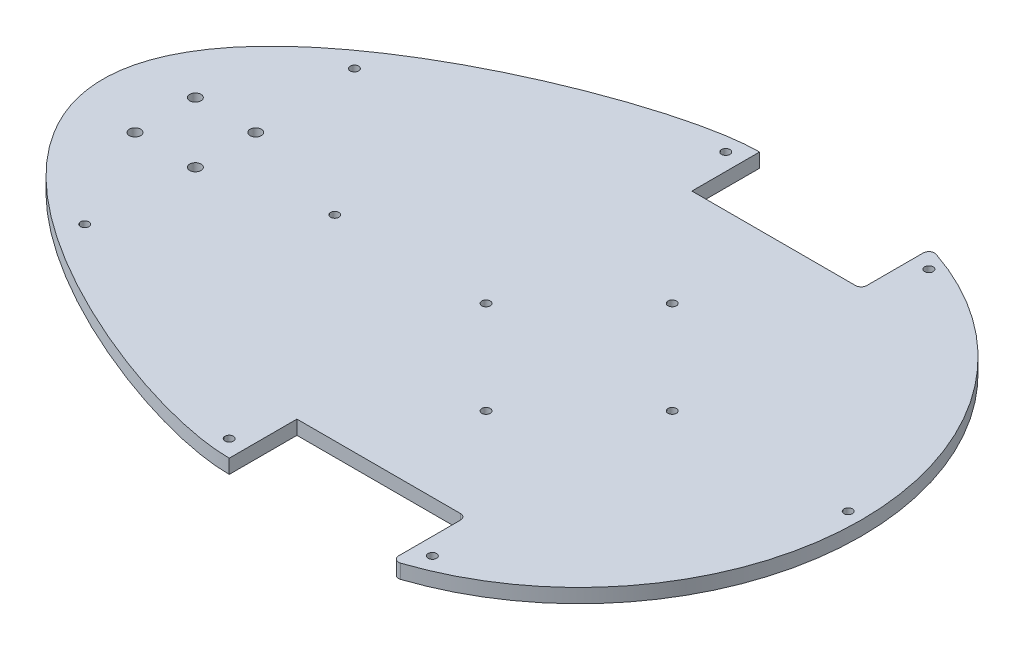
ISO-10303-21;
HEADER;
FILE_DESCRIPTION(('STEP AP214'),'2;1');
FILE_NAME('part.step','',(''),(''),'','','');
FILE_SCHEMA(('AUTOMOTIVE_DESIGN { 1 0 10303 214 1 1 1 1 }'));
ENDSEC;
DATA;
#1=APPLICATION_CONTEXT('core data for automotive mechanical design processes');
#2=APPLICATION_PROTOCOL_DEFINITION('international standard','automotive_design',2000,#1);
#3=PRODUCT_CONTEXT('',#1,'mechanical');
#4=PRODUCT('Part','Part','',(#3));
#5=PRODUCT_RELATED_PRODUCT_CATEGORY('part','',(#4));
#6=PRODUCT_DEFINITION_FORMATION('','',#4);
#7=PRODUCT_DEFINITION_CONTEXT('part definition',#1,'design');
#8=PRODUCT_DEFINITION('design','',#6,#7);
#9=PRODUCT_DEFINITION_SHAPE('','',#8);
#10=(LENGTH_UNIT() NAMED_UNIT(*) SI_UNIT(.MILLI.,.METRE.));
#11=(NAMED_UNIT(*) PLANE_ANGLE_UNIT() SI_UNIT($,.RADIAN.));
#12=(NAMED_UNIT(*) SI_UNIT($,.STERADIAN.) SOLID_ANGLE_UNIT());
#13=UNCERTAINTY_MEASURE_WITH_UNIT(LENGTH_MEASURE(1.E-05),#10,'distance_accuracy_value','');
#14=(GEOMETRIC_REPRESENTATION_CONTEXT(3) GLOBAL_UNCERTAINTY_ASSIGNED_CONTEXT((#13)) GLOBAL_UNIT_ASSIGNED_CONTEXT((#10,
#11,#12)) REPRESENTATION_CONTEXT('',''));
#15=CARTESIAN_POINT('',(0.,0.,0.));
#16=DIRECTION('',(0.,0.,1.));
#17=DIRECTION('',(1.,0.,0.));
#18=AXIS2_PLACEMENT_3D('',#15,#16,#17);
#19=CARTESIAN_POINT('',(-138.776487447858,6.35,-10.414919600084));
#20=DIRECTION('',(0.,-1.,0.));
#21=DIRECTION('',(0.,0.,-1.));
#22=AXIS2_PLACEMENT_3D('',#19,#20,#21);
#23=PLANE('',#22);
#24=CARTESIAN_POINT('',(-33.683987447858,6.35,-9.65291960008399));
#25=DIRECTION('',(0.,1.,0.));
#26=DIRECTION('',(0.,0.,1.));
#27=AXIS2_PLACEMENT_3D('',#24,#25,#26);
#28=CIRCLE('',#27,1.905);
#29=CARTESIAN_POINT('',(-33.683987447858,6.35,-7.74791960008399));
#30=VERTEX_POINT('',#29);
#31=EDGE_CURVE('E306',#30,#30,#28,.T.);
#32=ORIENTED_EDGE('',*,*,#31,.F.);
#33=EDGE_LOOP('',(#32));
#34=FACE_BOUND('',#33,.T.);
#35=CARTESIAN_POINT('',(197.456012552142,6.35,-9.65291960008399));
#36=DIRECTION('',(0.,1.,0.));
#37=DIRECTION('',(0.,0.,1.));
#38=AXIS2_PLACEMENT_3D('',#35,#36,#37);
#39=CIRCLE('',#38,1.90499999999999);
#40=CARTESIAN_POINT('',(197.456012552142,6.35,-7.747919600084));
#41=VERTEX_POINT('',#40);
#42=EDGE_CURVE('E300',#41,#41,#39,.T.);
#43=ORIENTED_EDGE('',*,*,#42,.F.);
#44=EDGE_LOOP('',(#43));
#45=FACE_BOUND('',#44,.T.);
#46=CARTESIAN_POINT('',(-86.2919229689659,6.35,-71.120919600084));
#47=DIRECTION('',(0.,1.,0.));
#48=DIRECTION('',(0.,0.,1.));
#49=AXIS2_PLACEMENT_3D('',#46,#47,#48);
#50=CIRCLE('',#49,1.90500000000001);
#51=CARTESIAN_POINT('',(-86.2919229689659,6.35,-69.215919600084));
#52=VERTEX_POINT('',#51);
#53=EDGE_CURVE('E292',#52,#52,#50,.T.);
#54=ORIENTED_EDGE('',*,*,#53,.F.);
#55=EDGE_LOOP('',(#54));
#56=FACE_BOUND('',#55,.T.);
#57=CARTESIAN_POINT('',(-86.2919229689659,6.35,50.291080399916));
#58=DIRECTION('',(0.,1.,0.));
#59=DIRECTION('',(0.,0.,1.));
#60=AXIS2_PLACEMENT_3D('',#57,#58,#59);
#61=CIRCLE('',#60,1.90500000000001);
#62=CARTESIAN_POINT('',(-86.2919229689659,6.35,52.196080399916));
#63=VERTEX_POINT('',#62);
#64=EDGE_CURVE('E285',#63,#63,#61,.T.);
#65=ORIENTED_EDGE('',*,*,#64,.F.);
#66=EDGE_LOOP('',(#65));
#67=FACE_BOUND('',#66,.T.);
#68=CARTESIAN_POINT('',(29.816012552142,6.35,101.345080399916));
#69=DIRECTION('',(0.,1.,0.));
#70=DIRECTION('',(0.,0.,1.));
#71=AXIS2_PLACEMENT_3D('',#68,#69,#70);
#72=CIRCLE('',#71,1.905);
#73=CARTESIAN_POINT('',(29.816012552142,6.35,103.250080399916));
#74=VERTEX_POINT('',#73);
#75=EDGE_CURVE('E289',#74,#74,#72,.T.);
#76=ORIENTED_EDGE('',*,*,#75,.F.);
#77=EDGE_LOOP('',(#76));
#78=FACE_BOUND('',#77,.T.);
#79=CARTESIAN_POINT('',(29.816012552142,6.35,-122.174919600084));
#80=DIRECTION('',(0.,1.,0.));
#81=DIRECTION('',(0.,0.,1.));
#82=AXIS2_PLACEMENT_3D('',#79,#80,#81);
#83=CIRCLE('',#82,1.905);
#84=CARTESIAN_POINT('',(29.816012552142,6.35,-120.269919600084));
#85=VERTEX_POINT('',#84);
#86=EDGE_CURVE('E319',#85,#85,#83,.T.);
#87=ORIENTED_EDGE('',*,*,#86,.F.);
#88=EDGE_LOOP('',(#87));
#89=FACE_BOUND('',#88,.T.);
#90=CARTESIAN_POINT('',(121.256012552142,6.35,-122.174919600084));
#91=DIRECTION('',(0.,1.,0.));
#92=DIRECTION('',(0.,0.,1.));
#93=AXIS2_PLACEMENT_3D('',#90,#91,#92);
#94=CIRCLE('',#93,1.90500000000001);
#95=CARTESIAN_POINT('',(121.256012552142,6.35,-120.269919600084));
#96=VERTEX_POINT('',#95);
#97=EDGE_CURVE('E313',#96,#96,#94,.T.);
#98=ORIENTED_EDGE('',*,*,#97,.F.);
#99=EDGE_LOOP('',(#98));
#100=FACE_BOUND('',#99,.T.);
#101=CARTESIAN_POINT('',(121.256012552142,6.35,101.345080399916));
#102=DIRECTION('',(0.,1.,0.));
#103=DIRECTION('',(0.,0.,1.));
#104=AXIS2_PLACEMENT_3D('',#101,#102,#103);
#105=CIRCLE('',#104,1.90500000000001);
#106=CARTESIAN_POINT('',(121.256012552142,6.35,103.250080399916));
#107=VERTEX_POINT('',#106);
#108=EDGE_CURVE('E312',#107,#107,#105,.T.);
#109=ORIENTED_EDGE('',*,*,#108,.F.);
#110=EDGE_LOOP('',(#109));
#111=FACE_BOUND('',#110,.T.);
#112=DIRECTION('',(0.,0.,-1.));
#113=VECTOR('',#112,1.);
#114=CARTESIAN_POINT('',(37.4360125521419,6.35,78.485080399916));
#115=LINE('',#114,#113);
#116=CARTESIAN_POINT('',(37.436012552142,6.35,108.965080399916));
#117=VERTEX_POINT('',#116);
#118=CARTESIAN_POINT('',(37.4360125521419,6.35,78.485080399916));
#119=VERTEX_POINT('',#118);
#120=EDGE_CURVE('E380',#117,#119,#115,.T.);
#121=ORIENTED_EDGE('',*,*,#120,.T.);
#122=DIRECTION('',(1.,0.,0.));
#123=VECTOR('',#122,1.);
#124=CARTESIAN_POINT('',(37.4360125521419,6.35,78.485080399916));
#125=LINE('',#124,#123);
#126=CARTESIAN_POINT('',(111.096012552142,6.35,78.485080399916));
#127=VERTEX_POINT('',#126);
#128=EDGE_CURVE('E104',#119,#127,#125,.T.);
#129=ORIENTED_EDGE('',*,*,#128,.T.);
#130=CARTESIAN_POINT('',(111.096012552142,6.35,81.025080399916));
#131=DIRECTION('',(0.,-1.,0.));
#132=DIRECTION('',(0.,0.,-1.));
#133=AXIS2_PLACEMENT_3D('',#130,#131,#132);
#134=CIRCLE('',#133,2.54);
#135=CARTESIAN_POINT('',(113.636012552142,6.35,81.025080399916));
#136=VERTEX_POINT('',#135);
#137=EDGE_CURVE('E383',#127,#136,#134,.T.);
#138=ORIENTED_EDGE('',*,*,#137,.T.);
#139=DIRECTION('',(0.,0.,1.));
#140=VECTOR('',#139,1.);
#141=CARTESIAN_POINT('',(113.636012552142,6.35,81.025080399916));
#142=LINE('',#141,#140);
#143=CARTESIAN_POINT('',(113.636012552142,6.35,108.883130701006));
#144=VERTEX_POINT('',#143);
#145=EDGE_CURVE('E385',#136,#144,#142,.T.);
#146=ORIENTED_EDGE('',*,*,#145,.T.);
#147=CARTESIAN_POINT('',(116.176012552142,6.35,108.883130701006));
#148=DIRECTION('',(0.,1.,0.));
#149=DIRECTION('',(0.,0.,1.));
#150=AXIS2_PLACEMENT_3D('',#147,#148,#149);
#151=CIRCLE('',#150,2.54);
#152=CARTESIAN_POINT('',(116.979481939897,6.35,111.292702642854));
#153=VERTEX_POINT('',#152);
#154=EDGE_CURVE('E387',#144,#153,#151,.T.);
#155=ORIENTED_EDGE('',*,*,#154,.T.);
#156=CARTESIAN_POINT('',(76.806012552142,6.35,-9.18589444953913));
#157=DIRECTION('',(0.,1.,0.));
#158=DIRECTION('',(0.,0.,1.));
#159=AXIS2_PLACEMENT_3D('',#156,#157,#158);
#160=CIRCLE('',#159,127.);
#161=CARTESIAN_POINT('',(116.979481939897,6.35,-129.664491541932));
#162=VERTEX_POINT('',#161);
#163=EDGE_CURVE('E389',#153,#162,#160,.T.);
#164=ORIENTED_EDGE('',*,*,#163,.T.);
#165=CARTESIAN_POINT('',(116.176012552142,6.35,-127.254919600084));
#166=DIRECTION('',(0.,1.,0.));
#167=DIRECTION('',(0.,0.,-1.));
#168=AXIS2_PLACEMENT_3D('',#165,#166,#167);
#169=CIRCLE('',#168,2.54000000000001);
#170=CARTESIAN_POINT('',(113.636012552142,6.35,-127.254919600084));
#171=VERTEX_POINT('',#170);
#172=EDGE_CURVE('E391',#162,#171,#169,.T.);
#173=ORIENTED_EDGE('',*,*,#172,.T.);
#174=DIRECTION('',(0.,0.,1.));
#175=VECTOR('',#174,1.);
#176=CARTESIAN_POINT('',(113.636012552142,6.35,-127.254919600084));
#177=LINE('',#176,#175);
#178=CARTESIAN_POINT('',(113.636012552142,6.35,-101.854919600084));
#179=VERTEX_POINT('',#178);
#180=EDGE_CURVE('E393',#171,#179,#177,.T.);
#181=ORIENTED_EDGE('',*,*,#180,.T.);
#182=CARTESIAN_POINT('',(111.096012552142,6.35,-101.854919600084));
#183=DIRECTION('',(0.,-1.,0.));
#184=DIRECTION('',(0.,0.,1.));
#185=AXIS2_PLACEMENT_3D('',#182,#183,#184);
#186=CIRCLE('',#185,2.54000000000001);
#187=CARTESIAN_POINT('',(111.096012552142,6.35,-99.314919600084));
#188=VERTEX_POINT('',#187);
#189=EDGE_CURVE('E135',#179,#188,#186,.T.);
#190=ORIENTED_EDGE('',*,*,#189,.T.);
#191=DIRECTION('',(-1.,0.,0.));
#192=VECTOR('',#191,1.);
#193=CARTESIAN_POINT('',(37.436012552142,6.35,-99.314919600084));
#194=LINE('',#193,#192);
#195=CARTESIAN_POINT('',(37.436012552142,6.35,-99.314919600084));
#196=VERTEX_POINT('',#195);
#197=EDGE_CURVE('E129',#188,#196,#194,.T.);
#198=ORIENTED_EDGE('',*,*,#197,.T.);
#199=DIRECTION('',(0.,0.,-1.));
#200=VECTOR('',#199,1.);
#201=CARTESIAN_POINT('',(37.436012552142,6.35,-99.314919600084));
#202=LINE('',#201,#200);
#203=CARTESIAN_POINT('',(37.4360125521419,6.35,-129.794919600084));
#204=VERTEX_POINT('',#203);
#205=EDGE_CURVE('E133',#196,#204,#202,.T.);
#206=ORIENTED_EDGE('',*,*,#205,.T.);
#207=CARTESIAN_POINT('',(37.4360125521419,6.35,-129.794919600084));
#208=CARTESIAN_POINT('',(-26.0639874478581,6.35,-129.794919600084));
#209=CARTESIAN_POINT('',(-212.753987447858,6.35,-40.894919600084));
#210=CARTESIAN_POINT('',(-212.753987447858,6.35,20.065080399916));
#211=CARTESIAN_POINT('',(-26.063987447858,6.35,108.965080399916));
#212=CARTESIAN_POINT('',(37.436012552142,6.35,108.965080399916));
#213=B_SPLINE_CURVE_WITH_KNOTS('',5,(#207,#208,#209,#210,#211,#212),.UNSPECIFIED.,.F.,.F.,(6,6),
(0.,1.),.UNSPECIFIED.);
#214=EDGE_CURVE('E49',#204,#117,#213,.T.);
#215=ORIENTED_EDGE('',*,*,#214,.T.);
#216=EDGE_LOOP('',(#121,#129,#138,#146,#155,#164,#173,#181,#190,#198,#206,#215));
#217=FACE_BOUND('',#216,.T.);
#218=CARTESIAN_POINT('',(-83.594987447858,6.35,3.174080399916));
#219=DIRECTION('',(0.,1.,0.));
#220=DIRECTION('',(0.,0.,1.));
#221=AXIS2_PLACEMENT_3D('',#218,#219,#220);
#222=CIRCLE('',#221,2.54000000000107);
#223=CARTESIAN_POINT('',(-83.594987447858,6.35,5.71408039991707));
#224=VERTEX_POINT('',#223);
#225=EDGE_CURVE('E375',#224,#224,#222,.T.);
#226=ORIENTED_EDGE('',*,*,#225,.F.);
#227=EDGE_LOOP('',(#226));
#228=FACE_BOUND('',#227,.T.);
#229=CARTESIAN_POINT('',(-110.772987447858,6.35,3.174080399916));
#230=DIRECTION('',(0.,1.,0.));
#231=DIRECTION('',(0.,0.,1.));
#232=AXIS2_PLACEMENT_3D('',#229,#230,#231);
#233=CIRCLE('',#232,2.5400000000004);
#234=CARTESIAN_POINT('',(-110.772987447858,6.35,5.7140803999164));
#235=VERTEX_POINT('',#234);
#236=EDGE_CURVE('E369',#235,#235,#233,.T.);
#237=ORIENTED_EDGE('',*,*,#236,.F.);
#238=EDGE_LOOP('',(#237));
#239=FACE_BOUND('',#238,.T.);
#240=CARTESIAN_POINT('',(-110.772987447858,6.35,-24.003919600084));
#241=DIRECTION('',(0.,1.,0.));
#242=DIRECTION('',(0.,0.,1.));
#243=AXIS2_PLACEMENT_3D('',#240,#241,#242);
#244=CIRCLE('',#243,2.54000000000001);
#245=CARTESIAN_POINT('',(-110.772987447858,6.35,-21.463919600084));
#246=VERTEX_POINT('',#245);
#247=EDGE_CURVE('E363',#246,#246,#244,.T.);
#248=ORIENTED_EDGE('',*,*,#247,.F.);
#249=EDGE_LOOP('',(#248));
#250=FACE_BOUND('',#249,.T.);
#251=CARTESIAN_POINT('',(-83.594987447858,6.35,-24.003919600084));
#252=DIRECTION('',(0.,1.,0.));
#253=DIRECTION('',(0.,0.,1.));
#254=AXIS2_PLACEMENT_3D('',#251,#252,#253);
#255=CIRCLE('',#254,2.54000000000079);
#256=CARTESIAN_POINT('',(-83.594987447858,6.35,-21.4639196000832));
#257=VERTEX_POINT('',#256);
#258=EDGE_CURVE('E357',#257,#257,#255,.T.);
#259=ORIENTED_EDGE('',*,*,#258,.F.);
#260=EDGE_LOOP('',(#259));
#261=FACE_BOUND('',#260,.T.);
#262=CARTESIAN_POINT('',(76.806012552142,6.35,-51.0958944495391));
#263=DIRECTION('',(0.,1.,0.));
#264=DIRECTION('',(0.,0.,1.));
#265=AXIS2_PLACEMENT_3D('',#262,#263,#264);
#266=CIRCLE('',#265,1.90500000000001);
#267=CARTESIAN_POINT('',(76.806012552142,6.35,-49.1908944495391));
#268=VERTEX_POINT('',#267);
#269=EDGE_CURVE('E351',#268,#268,#266,.T.);
#270=ORIENTED_EDGE('',*,*,#269,.F.);
#271=EDGE_LOOP('',(#270));
#272=FACE_BOUND('',#271,.T.);
#273=CARTESIAN_POINT('',(34.8960125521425,6.35,-9.18589444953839));
#274=DIRECTION('',(0.,1.,0.));
#275=DIRECTION('',(0.,0.,1.));
#276=AXIS2_PLACEMENT_3D('',#273,#274,#275);
#277=CIRCLE('',#276,1.90500000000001);
#278=CARTESIAN_POINT('',(34.8960125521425,6.35,-7.28089444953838));
#279=VERTEX_POINT('',#278);
#280=EDGE_CURVE('E345',#279,#279,#277,.T.);
#281=ORIENTED_EDGE('',*,*,#280,.F.);
#282=EDGE_LOOP('',(#281));
#283=FACE_BOUND('',#282,.T.);
#284=CARTESIAN_POINT('',(76.8060125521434,6.35,32.7241055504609));
#285=DIRECTION('',(0.,1.,0.));
#286=DIRECTION('',(0.,0.,1.));
#287=AXIS2_PLACEMENT_3D('',#284,#285,#286);
#288=CIRCLE('',#287,1.90500000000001);
#289=CARTESIAN_POINT('',(76.8060125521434,6.35,34.6291055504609));
#290=VERTEX_POINT('',#289);
#291=EDGE_CURVE('E339',#290,#290,#288,.T.);
#292=ORIENTED_EDGE('',*,*,#291,.F.);
#293=EDGE_LOOP('',(#292));
#294=FACE_BOUND('',#293,.T.);
#295=CARTESIAN_POINT('',(118.716012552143,6.35,-9.18589444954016));
#296=DIRECTION('',(0.,1.,0.));
#297=DIRECTION('',(0.,0.,1.));
#298=AXIS2_PLACEMENT_3D('',#295,#296,#297);
#299=CIRCLE('',#298,1.90500000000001);
#300=CARTESIAN_POINT('',(118.716012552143,6.35,-7.28089444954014));
#301=VERTEX_POINT('',#300);
#302=EDGE_CURVE('E333',#301,#301,#299,.T.);
#303=ORIENTED_EDGE('',*,*,#302,.F.);
#304=EDGE_LOOP('',(#303));
#305=FACE_BOUND('',#304,.T.);
#306=ADVANCED_FACE('F32',(#34,#45,#56,#67,#78,#89,#100,#111,#217,#228,#239,#250,#261,#272,#283,
#294,#305),#23,.F.);
#307=CARTESIAN_POINT('',(-138.776487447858,0.,-10.414919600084));
#308=DIRECTION('',(0.,-1.,0.));
#309=DIRECTION('',(0.,0.,-1.));
#310=AXIS2_PLACEMENT_3D('',#307,#308,#309);
#311=PLANE('',#310);
#312=CARTESIAN_POINT('',(-33.683987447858,0.,-9.65291960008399));
#313=DIRECTION('',(0.,1.,0.));
#314=DIRECTION('',(0.,0.,1.));
#315=AXIS2_PLACEMENT_3D('',#312,#313,#314);
#316=CIRCLE('',#315,1.905);
#317=CARTESIAN_POINT('',(-33.683987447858,0.,-7.74791960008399));
#318=VERTEX_POINT('',#317);
#319=EDGE_CURVE('E303',#318,#318,#316,.T.);
#320=ORIENTED_EDGE('',*,*,#319,.T.);
#321=EDGE_LOOP('',(#320));
#322=FACE_BOUND('',#321,.T.);
#323=CARTESIAN_POINT('',(197.456012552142,0.,-9.65291960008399));
#324=DIRECTION('',(0.,1.,0.));
#325=DIRECTION('',(0.,0.,1.));
#326=AXIS2_PLACEMENT_3D('',#323,#324,#325);
#327=CIRCLE('',#326,1.90499999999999);
#328=CARTESIAN_POINT('',(197.456012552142,0.,-7.747919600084));
#329=VERTEX_POINT('',#328);
#330=EDGE_CURVE('E297',#329,#329,#327,.T.);
#331=ORIENTED_EDGE('',*,*,#330,.T.);
#332=EDGE_LOOP('',(#331));
#333=FACE_BOUND('',#332,.T.);
#334=CARTESIAN_POINT('',(-86.2919229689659,0.,-71.120919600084));
#335=DIRECTION('',(0.,1.,0.));
#336=DIRECTION('',(0.,0.,1.));
#337=AXIS2_PLACEMENT_3D('',#334,#335,#336);
#338=CIRCLE('',#337,1.90500000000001);
#339=CARTESIAN_POINT('',(-86.2919229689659,0.,-69.215919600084));
#340=VERTEX_POINT('',#339);
#341=EDGE_CURVE('E287',#340,#340,#338,.T.);
#342=ORIENTED_EDGE('',*,*,#341,.T.);
#343=EDGE_LOOP('',(#342));
#344=FACE_BOUND('',#343,.T.);
#345=CARTESIAN_POINT('',(-86.2919229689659,0.,50.291080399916));
#346=DIRECTION('',(0.,1.,0.));
#347=DIRECTION('',(0.,0.,1.));
#348=AXIS2_PLACEMENT_3D('',#345,#346,#347);
#349=CIRCLE('',#348,1.90500000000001);
#350=CARTESIAN_POINT('',(-86.2919229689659,0.,52.196080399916));
#351=VERTEX_POINT('',#350);
#352=EDGE_CURVE('E282',#351,#351,#349,.T.);
#353=ORIENTED_EDGE('',*,*,#352,.T.);
#354=EDGE_LOOP('',(#353));
#355=FACE_BOUND('',#354,.T.);
#356=CARTESIAN_POINT('',(29.816012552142,0.,101.345080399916));
#357=DIRECTION('',(0.,1.,0.));
#358=DIRECTION('',(0.,0.,1.));
#359=AXIS2_PLACEMENT_3D('',#356,#357,#358);
#360=CIRCLE('',#359,1.905);
#361=CARTESIAN_POINT('',(29.816012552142,0.,103.250080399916));
#362=VERTEX_POINT('',#361);
#363=EDGE_CURVE('E322',#362,#362,#360,.T.);
#364=ORIENTED_EDGE('',*,*,#363,.T.);
#365=EDGE_LOOP('',(#364));
#366=FACE_BOUND('',#365,.T.);
#367=CARTESIAN_POINT('',(29.816012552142,0.,-122.174919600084));
#368=DIRECTION('',(0.,1.,0.));
#369=DIRECTION('',(0.,0.,1.));
#370=AXIS2_PLACEMENT_3D('',#367,#368,#369);
#371=CIRCLE('',#370,1.905);
#372=CARTESIAN_POINT('',(29.816012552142,0.,-120.269919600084));
#373=VERTEX_POINT('',#372);
#374=EDGE_CURVE('E316',#373,#373,#371,.T.);
#375=ORIENTED_EDGE('',*,*,#374,.T.);
#376=EDGE_LOOP('',(#375));
#377=FACE_BOUND('',#376,.T.);
#378=CARTESIAN_POINT('',(121.256012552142,0.,-122.174919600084));
#379=DIRECTION('',(0.,1.,0.));
#380=DIRECTION('',(0.,0.,1.));
#381=AXIS2_PLACEMENT_3D('',#378,#379,#380);
#382=CIRCLE('',#381,1.90500000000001);
#383=CARTESIAN_POINT('',(121.256012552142,0.,-120.269919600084));
#384=VERTEX_POINT('',#383);
#385=EDGE_CURVE('E309',#384,#384,#382,.T.);
#386=ORIENTED_EDGE('',*,*,#385,.T.);
#387=EDGE_LOOP('',(#386));
#388=FACE_BOUND('',#387,.T.);
#389=CARTESIAN_POINT('',(121.256012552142,0.,101.345080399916));
#390=DIRECTION('',(0.,1.,0.));
#391=DIRECTION('',(0.,0.,1.));
#392=AXIS2_PLACEMENT_3D('',#389,#390,#391);
#393=CIRCLE('',#392,1.90500000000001);
#394=CARTESIAN_POINT('',(121.256012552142,0.,103.250080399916));
#395=VERTEX_POINT('',#394);
#396=EDGE_CURVE('E327',#395,#395,#393,.T.);
#397=ORIENTED_EDGE('',*,*,#396,.T.);
#398=EDGE_LOOP('',(#397));
#399=FACE_BOUND('',#398,.T.);
#400=CARTESIAN_POINT('',(76.8060125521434,0.,32.7241055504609));
#401=DIRECTION('',(0.,1.,0.));
#402=DIRECTION('',(0.,0.,1.));
#403=AXIS2_PLACEMENT_3D('',#400,#401,#402);
#404=CIRCLE('',#403,1.90500000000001);
#405=CARTESIAN_POINT('',(76.8060125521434,0.,34.6291055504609));
#406=VERTEX_POINT('',#405);
#407=EDGE_CURVE('E336',#406,#406,#404,.T.);
#408=ORIENTED_EDGE('',*,*,#407,.T.);
#409=EDGE_LOOP('',(#408));
#410=FACE_BOUND('',#409,.T.);
#411=CARTESIAN_POINT('',(76.806012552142,0.,-51.0958944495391));
#412=DIRECTION('',(0.,1.,0.));
#413=DIRECTION('',(0.,0.,1.));
#414=AXIS2_PLACEMENT_3D('',#411,#412,#413);
#415=CIRCLE('',#414,1.90500000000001);
#416=CARTESIAN_POINT('',(76.806012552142,0.,-49.1908944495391));
#417=VERTEX_POINT('',#416);
#418=EDGE_CURVE('E348',#417,#417,#415,.T.);
#419=ORIENTED_EDGE('',*,*,#418,.T.);
#420=EDGE_LOOP('',(#419));
#421=FACE_BOUND('',#420,.T.);
#422=CARTESIAN_POINT('',(-110.772987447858,0.,-24.003919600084));
#423=DIRECTION('',(0.,1.,0.));
#424=DIRECTION('',(0.,0.,1.));
#425=AXIS2_PLACEMENT_3D('',#422,#423,#424);
#426=CIRCLE('',#425,2.54000000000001);
#427=CARTESIAN_POINT('',(-110.772987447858,0.,-21.463919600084));
#428=VERTEX_POINT('',#427);
#429=EDGE_CURVE('E360',#428,#428,#426,.T.);
#430=ORIENTED_EDGE('',*,*,#429,.T.);
#431=EDGE_LOOP('',(#430));
#432=FACE_BOUND('',#431,.T.);
#433=CARTESIAN_POINT('',(-83.594987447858,0.,3.174080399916));
#434=DIRECTION('',(0.,1.,0.));
#435=DIRECTION('',(0.,0.,1.));
#436=AXIS2_PLACEMENT_3D('',#433,#434,#435);
#437=CIRCLE('',#436,2.54000000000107);
#438=CARTESIAN_POINT('',(-83.594987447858,0.,5.71408039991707));
#439=VERTEX_POINT('',#438);
#440=EDGE_CURVE('E372',#439,#439,#437,.T.);
#441=ORIENTED_EDGE('',*,*,#440,.T.);
#442=EDGE_LOOP('',(#441));
#443=FACE_BOUND('',#442,.T.);
#444=DIRECTION('',(0.,0.,-1.));
#445=VECTOR('',#444,1.);
#446=CARTESIAN_POINT('',(37.4360125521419,0.,78.485080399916));
#447=LINE('',#446,#445);
#448=CARTESIAN_POINT('',(37.436012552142,0.,108.965080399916));
#449=VERTEX_POINT('',#448);
#450=CARTESIAN_POINT('',(37.4360125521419,0.,78.485080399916));
#451=VERTEX_POINT('',#450);
#452=EDGE_CURVE('E156',#449,#451,#447,.T.);
#453=ORIENTED_EDGE('',*,*,#452,.F.);
#454=CARTESIAN_POINT('',(37.4360125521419,0.,-129.794919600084));
#455=CARTESIAN_POINT('',(-26.0639874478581,0.,-129.794919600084));
#456=CARTESIAN_POINT('',(-212.753987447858,0.,-40.894919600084));
#457=CARTESIAN_POINT('',(-212.753987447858,0.,20.065080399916));
#458=CARTESIAN_POINT('',(-26.063987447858,0.,108.965080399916));
#459=CARTESIAN_POINT('',(37.436012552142,0.,108.965080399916));
#460=B_SPLINE_CURVE_WITH_KNOTS('',5,(#454,#455,#456,#457,#458,#459),.UNSPECIFIED.,.F.,.F.,(6,6),
(0.,1.),.UNSPECIFIED.);
#461=CARTESIAN_POINT('',(37.4360125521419,0.,-129.794919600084));
#462=VERTEX_POINT('',#461);
#463=EDGE_CURVE('E96',#462,#449,#460,.T.);
#464=ORIENTED_EDGE('',*,*,#463,.F.);
#465=DIRECTION('',(0.,0.,-1.));
#466=VECTOR('',#465,1.);
#467=CARTESIAN_POINT('',(37.436012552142,0.,-99.314919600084));
#468=LINE('',#467,#466);
#469=CARTESIAN_POINT('',(37.436012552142,0.,-99.314919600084));
#470=VERTEX_POINT('',#469);
#471=EDGE_CURVE('E90',#470,#462,#468,.T.);
#472=ORIENTED_EDGE('',*,*,#471,.F.);
#473=DIRECTION('',(-1.,0.,0.));
#474=VECTOR('',#473,1.);
#475=CARTESIAN_POINT('',(37.436012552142,0.,-99.314919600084));
#476=LINE('',#475,#474);
#477=CARTESIAN_POINT('',(111.096012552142,0.,-99.314919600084));
#478=VERTEX_POINT('',#477);
#479=EDGE_CURVE('E143',#478,#470,#476,.T.);
#480=ORIENTED_EDGE('',*,*,#479,.F.);
#481=CARTESIAN_POINT('',(111.096012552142,0.,-101.854919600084));
#482=DIRECTION('',(0.,-1.,0.));
#483=DIRECTION('',(0.,0.,1.));
#484=AXIS2_PLACEMENT_3D('',#481,#482,#483);
#485=CIRCLE('',#484,2.54000000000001);
#486=CARTESIAN_POINT('',(113.636012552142,0.,-101.854919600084));
#487=VERTEX_POINT('',#486);
#488=EDGE_CURVE('E406',#487,#478,#485,.T.);
#489=ORIENTED_EDGE('',*,*,#488,.F.);
#490=DIRECTION('',(0.,0.,1.));
#491=VECTOR('',#490,1.);
#492=CARTESIAN_POINT('',(113.636012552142,0.,-127.254919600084));
#493=LINE('',#492,#491);
#494=CARTESIAN_POINT('',(113.636012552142,0.,-127.254919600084));
#495=VERTEX_POINT('',#494);
#496=EDGE_CURVE('E402',#495,#487,#493,.T.);
#497=ORIENTED_EDGE('',*,*,#496,.F.);
#498=CARTESIAN_POINT('',(116.176012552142,0.,-127.254919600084));
#499=DIRECTION('',(0.,1.,0.));
#500=DIRECTION('',(0.,0.,-1.));
#501=AXIS2_PLACEMENT_3D('',#498,#499,#500);
#502=CIRCLE('',#501,2.54000000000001);
#503=CARTESIAN_POINT('',(116.979481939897,0.,-129.664491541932));
#504=VERTEX_POINT('',#503);
#505=EDGE_CURVE('E441',#504,#495,#502,.T.);
#506=ORIENTED_EDGE('',*,*,#505,.F.);
#507=CARTESIAN_POINT('',(76.806012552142,0.,-9.18589444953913));
#508=DIRECTION('',(0.,1.,0.));
#509=DIRECTION('',(0.,0.,1.));
#510=AXIS2_PLACEMENT_3D('',#507,#508,#509);
#511=CIRCLE('',#510,127.);
#512=CARTESIAN_POINT('',(116.979481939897,0.,111.292702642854));
#513=VERTEX_POINT('',#512);
#514=EDGE_CURVE('E439',#513,#504,#511,.T.);
#515=ORIENTED_EDGE('',*,*,#514,.F.);
#516=CARTESIAN_POINT('',(116.176012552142,0.,108.883130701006));
#517=DIRECTION('',(0.,1.,0.));
#518=DIRECTION('',(0.,0.,1.));
#519=AXIS2_PLACEMENT_3D('',#516,#517,#518);
#520=CIRCLE('',#519,2.54);
#521=CARTESIAN_POINT('',(113.636012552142,0.,108.883130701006));
#522=VERTEX_POINT('',#521);
#523=EDGE_CURVE('E435',#522,#513,#520,.T.);
#524=ORIENTED_EDGE('',*,*,#523,.F.);
#525=DIRECTION('',(0.,0.,1.));
#526=VECTOR('',#525,1.);
#527=CARTESIAN_POINT('',(113.636012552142,0.,81.025080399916));
#528=LINE('',#527,#526);
#529=CARTESIAN_POINT('',(113.636012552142,0.,81.025080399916));
#530=VERTEX_POINT('',#529);
#531=EDGE_CURVE('E433',#530,#522,#528,.T.);
#532=ORIENTED_EDGE('',*,*,#531,.F.);
#533=CARTESIAN_POINT('',(111.096012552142,0.,81.025080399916));
#534=DIRECTION('',(0.,-1.,0.));
#535=DIRECTION('',(0.,0.,-1.));
#536=AXIS2_PLACEMENT_3D('',#533,#534,#535);
#537=CIRCLE('',#536,2.54);
#538=CARTESIAN_POINT('',(111.096012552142,0.,78.485080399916));
#539=VERTEX_POINT('',#538);
#540=EDGE_CURVE('E426',#539,#530,#537,.T.);
#541=ORIENTED_EDGE('',*,*,#540,.F.);
#542=DIRECTION('',(1.,0.,0.));
#543=VECTOR('',#542,1.);
#544=CARTESIAN_POINT('',(37.4360125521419,0.,78.485080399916));
#545=LINE('',#544,#543);
#546=EDGE_CURVE('E431',#451,#539,#545,.T.);
#547=ORIENTED_EDGE('',*,*,#546,.F.);
#548=EDGE_LOOP('',(#453,#464,#472,#480,#489,#497,#506,#515,#524,#532,#541,#547));
#549=FACE_BOUND('',#548,.T.);
#550=CARTESIAN_POINT('',(-110.772987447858,0.,3.174080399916));
#551=DIRECTION('',(0.,1.,0.));
#552=DIRECTION('',(0.,0.,1.));
#553=AXIS2_PLACEMENT_3D('',#550,#551,#552);
#554=CIRCLE('',#553,2.5400000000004);
#555=CARTESIAN_POINT('',(-110.772987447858,0.,5.7140803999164));
#556=VERTEX_POINT('',#555);
#557=EDGE_CURVE('E366',#556,#556,#554,.T.);
#558=ORIENTED_EDGE('',*,*,#557,.T.);
#559=EDGE_LOOP('',(#558));
#560=FACE_BOUND('',#559,.T.);
#561=CARTESIAN_POINT('',(-83.594987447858,0.,-24.003919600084));
#562=DIRECTION('',(0.,1.,0.));
#563=DIRECTION('',(0.,0.,1.));
#564=AXIS2_PLACEMENT_3D('',#561,#562,#563);
#565=CIRCLE('',#564,2.54000000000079);
#566=CARTESIAN_POINT('',(-83.594987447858,0.,-21.4639196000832));
#567=VERTEX_POINT('',#566);
#568=EDGE_CURVE('E354',#567,#567,#565,.T.);
#569=ORIENTED_EDGE('',*,*,#568,.T.);
#570=EDGE_LOOP('',(#569));
#571=FACE_BOUND('',#570,.T.);
#572=CARTESIAN_POINT('',(34.8960125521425,0.,-9.18589444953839));
#573=DIRECTION('',(0.,1.,0.));
#574=DIRECTION('',(0.,0.,1.));
#575=AXIS2_PLACEMENT_3D('',#572,#573,#574);
#576=CIRCLE('',#575,1.90500000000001);
#577=CARTESIAN_POINT('',(34.8960125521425,0.,-7.28089444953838));
#578=VERTEX_POINT('',#577);
#579=EDGE_CURVE('E342',#578,#578,#576,.T.);
#580=ORIENTED_EDGE('',*,*,#579,.T.);
#581=EDGE_LOOP('',(#580));
#582=FACE_BOUND('',#581,.T.);
#583=CARTESIAN_POINT('',(118.716012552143,0.,-9.18589444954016));
#584=DIRECTION('',(0.,1.,0.));
#585=DIRECTION('',(0.,0.,1.));
#586=AXIS2_PLACEMENT_3D('',#583,#584,#585);
#587=CIRCLE('',#586,1.90500000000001);
#588=CARTESIAN_POINT('',(118.716012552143,0.,-7.28089444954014));
#589=VERTEX_POINT('',#588);
#590=EDGE_CURVE('E330',#589,#589,#587,.T.);
#591=ORIENTED_EDGE('',*,*,#590,.T.);
#592=EDGE_LOOP('',(#591));
#593=FACE_BOUND('',#592,.T.);
#594=ADVANCED_FACE('F167',(#322,#333,#344,#355,#366,#377,#388,#399,#410,#421,#432,#443,#549,
#560,#571,#582,#593),#311,.T.);
#595=CARTESIAN_POINT('',(37.4360125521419,6.35,78.485080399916));
#596=DIRECTION('',(-1.,0.,0.));
#597=DIRECTION('',(0.,0.,1.));
#598=AXIS2_PLACEMENT_3D('',#595,#596,#597);
#599=PLANE('',#598);
#600=ORIENTED_EDGE('',*,*,#452,.T.);
#601=DIRECTION('',(0.,-1.,0.));
#602=VECTOR('',#601,1.);
#603=CARTESIAN_POINT('',(37.4360125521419,6.35,78.485080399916));
#604=LINE('',#603,#602);
#605=EDGE_CURVE('E11',#119,#451,#604,.T.);
#606=ORIENTED_EDGE('',*,*,#605,.F.);
#607=ORIENTED_EDGE('',*,*,#120,.F.);
#608=DIRECTION('',(0.,-1.,0.));
#609=VECTOR('',#608,1.);
#610=CARTESIAN_POINT('',(37.436012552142,6.35,108.965080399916));
#611=LINE('',#610,#609);
#612=EDGE_CURVE('E149',#117,#449,#611,.T.);
#613=ORIENTED_EDGE('',*,*,#612,.T.);
#614=EDGE_LOOP('',(#600,#606,#607,#613));
#615=FACE_BOUND('',#614,.T.);
#616=ADVANCED_FACE('F34',(#615),#599,.F.);
#617=CARTESIAN_POINT('',(37.4360125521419,6.35,78.485080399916));
#618=DIRECTION('',(0.,0.,-1.));
#619=DIRECTION('',(-1.,0.,0.));
#620=AXIS2_PLACEMENT_3D('',#617,#618,#619);
#621=PLANE('',#620);
#622=ORIENTED_EDGE('',*,*,#546,.T.);
#623=DIRECTION('',(0.,-1.,0.));
#624=VECTOR('',#623,1.);
#625=CARTESIAN_POINT('',(111.096012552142,6.35,78.485080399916));
#626=LINE('',#625,#624);
#627=EDGE_CURVE('E41',#127,#539,#626,.T.);
#628=ORIENTED_EDGE('',*,*,#627,.F.);
#629=ORIENTED_EDGE('',*,*,#128,.F.);
#630=ORIENTED_EDGE('',*,*,#605,.T.);
#631=EDGE_LOOP('',(#622,#628,#629,#630));
#632=FACE_BOUND('',#631,.T.);
#633=ADVANCED_FACE('F199',(#632),#621,.F.);
#634=CARTESIAN_POINT('',(111.096012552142,6.35,81.025080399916));
#635=DIRECTION('',(0.,-1.,0.));
#636=DIRECTION('',(0.,0.,-1.));
#637=AXIS2_PLACEMENT_3D('',#634,#635,#636);
#638=CYLINDRICAL_SURFACE('',#637,2.54);
#639=ORIENTED_EDGE('',*,*,#540,.T.);
#640=DIRECTION('',(0.,-1.,0.));
#641=VECTOR('',#640,1.);
#642=CARTESIAN_POINT('',(113.636012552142,6.35,81.025080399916));
#643=LINE('',#642,#641);
#644=EDGE_CURVE('E420',#136,#530,#643,.T.);
#645=ORIENTED_EDGE('',*,*,#644,.F.);
#646=ORIENTED_EDGE('',*,*,#137,.F.);
#647=ORIENTED_EDGE('',*,*,#627,.T.);
#648=EDGE_LOOP('',(#639,#645,#646,#647));
#649=FACE_BOUND('',#648,.T.);
#650=ADVANCED_FACE('F196',(#649),#638,.F.);
#651=CARTESIAN_POINT('',(113.636012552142,6.35,81.025080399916));
#652=DIRECTION('',(1.,0.,0.));
#653=DIRECTION('',(0.,0.,-1.));
#654=AXIS2_PLACEMENT_3D('',#651,#652,#653);
#655=PLANE('',#654);
#656=ORIENTED_EDGE('',*,*,#531,.T.);
#657=DIRECTION('',(0.,-1.,0.));
#658=VECTOR('',#657,1.);
#659=CARTESIAN_POINT('',(113.636012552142,6.35,108.883130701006));
#660=LINE('',#659,#658);
#661=EDGE_CURVE('E417',#144,#522,#660,.T.);
#662=ORIENTED_EDGE('',*,*,#661,.F.);
#663=ORIENTED_EDGE('',*,*,#145,.F.);
#664=ORIENTED_EDGE('',*,*,#644,.T.);
#665=EDGE_LOOP('',(#656,#662,#663,#664));
#666=FACE_BOUND('',#665,.T.);
#667=ADVANCED_FACE('F192',(#666),#655,.F.);
#668=CARTESIAN_POINT('',(116.176012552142,6.35,108.883130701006));
#669=DIRECTION('',(0.,-1.,0.));
#670=DIRECTION('',(0.,0.,-1.));
#671=AXIS2_PLACEMENT_3D('',#668,#669,#670);
#672=CYLINDRICAL_SURFACE('',#671,2.54);
#673=ORIENTED_EDGE('',*,*,#523,.T.);
#674=DIRECTION('',(0.,-1.,0.));
#675=VECTOR('',#674,1.);
#676=CARTESIAN_POINT('',(116.979481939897,6.35,111.292702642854));
#677=LINE('',#676,#675);
#678=EDGE_CURVE('E414',#153,#513,#677,.T.);
#679=ORIENTED_EDGE('',*,*,#678,.F.);
#680=ORIENTED_EDGE('',*,*,#154,.F.);
#681=ORIENTED_EDGE('',*,*,#661,.T.);
#682=EDGE_LOOP('',(#673,#679,#680,#681));
#683=FACE_BOUND('',#682,.T.);
#684=ADVANCED_FACE('F188',(#683),#672,.T.);
#685=CARTESIAN_POINT('',(76.806012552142,6.35,-9.18589444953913));
#686=DIRECTION('',(0.,-1.,0.));
#687=DIRECTION('',(0.,0.,-1.));
#688=AXIS2_PLACEMENT_3D('',#685,#686,#687);
#689=CYLINDRICAL_SURFACE('',#688,127.);
#690=ORIENTED_EDGE('',*,*,#514,.T.);
#691=DIRECTION('',(0.,-1.,0.));
#692=VECTOR('',#691,1.);
#693=CARTESIAN_POINT('',(116.979481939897,6.35,-129.664491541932));
#694=LINE('',#693,#692);
#695=EDGE_CURVE('E411',#162,#504,#694,.T.);
#696=ORIENTED_EDGE('',*,*,#695,.F.);
#697=ORIENTED_EDGE('',*,*,#163,.F.);
#698=ORIENTED_EDGE('',*,*,#678,.T.);
#699=EDGE_LOOP('',(#690,#696,#697,#698));
#700=FACE_BOUND('',#699,.T.);
#701=ADVANCED_FACE('F184',(#700),#689,.T.);
#702=CARTESIAN_POINT('',(116.176012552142,6.35,-127.254919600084));
#703=DIRECTION('',(0.,-1.,0.));
#704=DIRECTION('',(0.,0.,-1.));
#705=AXIS2_PLACEMENT_3D('',#702,#703,#704);
#706=CYLINDRICAL_SURFACE('',#705,2.54000000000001);
#707=ORIENTED_EDGE('',*,*,#505,.T.);
#708=DIRECTION('',(0.,-1.,0.));
#709=VECTOR('',#708,1.);
#710=CARTESIAN_POINT('',(113.636012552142,6.35,-127.254919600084));
#711=LINE('',#710,#709);
#712=EDGE_CURVE('E404',#171,#495,#711,.T.);
#713=ORIENTED_EDGE('',*,*,#712,.F.);
#714=ORIENTED_EDGE('',*,*,#172,.F.);
#715=ORIENTED_EDGE('',*,*,#695,.T.);
#716=EDGE_LOOP('',(#707,#713,#714,#715));
#717=FACE_BOUND('',#716,.T.);
#718=ADVANCED_FACE('F180',(#717),#706,.T.);
#719=CARTESIAN_POINT('',(113.636012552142,6.35,-127.254919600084));
#720=DIRECTION('',(1.,0.,0.));
#721=DIRECTION('',(0.,0.,-1.));
#722=AXIS2_PLACEMENT_3D('',#719,#720,#721);
#723=PLANE('',#722);
#724=ORIENTED_EDGE('',*,*,#496,.T.);
#725=DIRECTION('',(0.,-1.,0.));
#726=VECTOR('',#725,1.);
#727=CARTESIAN_POINT('',(113.636012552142,6.35,-101.854919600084));
#728=LINE('',#727,#726);
#729=EDGE_CURVE('E400',#179,#487,#728,.T.);
#730=ORIENTED_EDGE('',*,*,#729,.F.);
#731=ORIENTED_EDGE('',*,*,#180,.F.);
#732=ORIENTED_EDGE('',*,*,#712,.T.);
#733=EDGE_LOOP('',(#724,#730,#731,#732));
#734=FACE_BOUND('',#733,.T.);
#735=ADVANCED_FACE('F176',(#734),#723,.F.);
#736=CARTESIAN_POINT('',(111.096012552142,6.35,-101.854919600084));
#737=DIRECTION('',(0.,-1.,0.));
#738=DIRECTION('',(0.,0.,-1.));
#739=AXIS2_PLACEMENT_3D('',#736,#737,#738);
#740=CYLINDRICAL_SURFACE('',#739,2.54000000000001);
#741=ORIENTED_EDGE('',*,*,#488,.T.);
#742=DIRECTION('',(0.,-1.,0.));
#743=VECTOR('',#742,1.);
#744=CARTESIAN_POINT('',(111.096012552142,6.35,-99.314919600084));
#745=LINE('',#744,#743);
#746=EDGE_CURVE('E144',#188,#478,#745,.T.);
#747=ORIENTED_EDGE('',*,*,#746,.F.);
#748=ORIENTED_EDGE('',*,*,#189,.F.);
#749=ORIENTED_EDGE('',*,*,#729,.T.);
#750=EDGE_LOOP('',(#741,#747,#748,#749));
#751=FACE_BOUND('',#750,.T.);
#752=ADVANCED_FACE('F173',(#751),#740,.F.);
#753=CARTESIAN_POINT('',(37.436012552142,6.35,-99.314919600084));
#754=DIRECTION('',(0.,0.,1.));
#755=DIRECTION('',(1.,0.,0.));
#756=AXIS2_PLACEMENT_3D('',#753,#754,#755);
#757=PLANE('',#756);
#758=ORIENTED_EDGE('',*,*,#479,.T.);
#759=DIRECTION('',(0.,-1.,0.));
#760=VECTOR('',#759,1.);
#761=CARTESIAN_POINT('',(37.436012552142,6.35,-99.314919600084));
#762=LINE('',#761,#760);
#763=EDGE_CURVE('E140',#196,#470,#762,.T.);
#764=ORIENTED_EDGE('',*,*,#763,.F.);
#765=ORIENTED_EDGE('',*,*,#197,.F.);
#766=ORIENTED_EDGE('',*,*,#746,.T.);
#767=EDGE_LOOP('',(#758,#764,#765,#766));
#768=FACE_BOUND('',#767,.T.);
#769=ADVANCED_FACE('F141',(#768),#757,.F.);
#770=CARTESIAN_POINT('',(37.436012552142,6.35,-99.314919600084));
#771=DIRECTION('',(-1.,0.,0.));
#772=DIRECTION('',(0.,0.,1.));
#773=AXIS2_PLACEMENT_3D('',#770,#771,#772);
#774=PLANE('',#773);
#775=ORIENTED_EDGE('',*,*,#471,.T.);
#776=DIRECTION('',(0.,-1.,0.));
#777=VECTOR('',#776,1.);
#778=CARTESIAN_POINT('',(37.4360125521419,6.35,-129.794919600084));
#779=LINE('',#778,#777);
#780=EDGE_CURVE('E145',#204,#462,#779,.T.);
#781=ORIENTED_EDGE('',*,*,#780,.F.);
#782=ORIENTED_EDGE('',*,*,#205,.F.);
#783=ORIENTED_EDGE('',*,*,#763,.T.);
#784=EDGE_LOOP('',(#775,#781,#782,#783));
#785=FACE_BOUND('',#784,.T.);
#786=ADVANCED_FACE('F147',(#785),#774,.F.);
#787=DIRECTION('',(0.,-1.,0.));
#788=VECTOR('',#787,1.);
#789=SURFACE_OF_LINEAR_EXTRUSION('',#213,#788);
#790=ORIENTED_EDGE('',*,*,#463,.T.);
#791=ORIENTED_EDGE('',*,*,#612,.F.);
#792=ORIENTED_EDGE('',*,*,#214,.F.);
#793=ORIENTED_EDGE('',*,*,#780,.T.);
#794=EDGE_LOOP('',(#790,#791,#792,#793));
#795=FACE_BOUND('',#794,.T.);
#796=ADVANCED_FACE('F162',(#795),#789,.F.);
#797=CARTESIAN_POINT('',(-83.594987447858,6.35,3.174080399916));
#798=DIRECTION('',(0.,-1.,0.));
#799=DIRECTION('',(0.,0.,-1.));
#800=AXIS2_PLACEMENT_3D('',#797,#798,#799);
#801=CYLINDRICAL_SURFACE('',#800,2.54000000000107);
#802=ORIENTED_EDGE('',*,*,#225,.T.);
#803=EDGE_LOOP('',(#802));
#804=FACE_BOUND('',#803,.T.);
#805=ORIENTED_EDGE('',*,*,#440,.F.);
#806=EDGE_LOOP('',(#805));
#807=FACE_BOUND('',#806,.T.);
#808=ADVANCED_FACE('F166',(#804,#807),#801,.F.);
#809=CARTESIAN_POINT('',(-110.772987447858,6.35,3.174080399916));
#810=DIRECTION('',(0.,-1.,0.));
#811=DIRECTION('',(0.,0.,-1.));
#812=AXIS2_PLACEMENT_3D('',#809,#810,#811);
#813=CYLINDRICAL_SURFACE('',#812,2.5400000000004);
#814=ORIENTED_EDGE('',*,*,#236,.T.);
#815=EDGE_LOOP('',(#814));
#816=FACE_BOUND('',#815,.T.);
#817=ORIENTED_EDGE('',*,*,#557,.F.);
#818=EDGE_LOOP('',(#817));
#819=FACE_BOUND('',#818,.T.);
#820=ADVANCED_FACE('F217',(#816,#819),#813,.F.);
#821=CARTESIAN_POINT('',(-110.772987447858,6.35,-24.003919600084));
#822=DIRECTION('',(0.,-1.,0.));
#823=DIRECTION('',(0.,0.,-1.));
#824=AXIS2_PLACEMENT_3D('',#821,#822,#823);
#825=CYLINDRICAL_SURFACE('',#824,2.54000000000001);
#826=ORIENTED_EDGE('',*,*,#247,.T.);
#827=EDGE_LOOP('',(#826));
#828=FACE_BOUND('',#827,.T.);
#829=ORIENTED_EDGE('',*,*,#429,.F.);
#830=EDGE_LOOP('',(#829));
#831=FACE_BOUND('',#830,.T.);
#832=ADVANCED_FACE('F221',(#828,#831),#825,.F.);
#833=CARTESIAN_POINT('',(-83.594987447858,6.35,-24.003919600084));
#834=DIRECTION('',(0.,-1.,0.));
#835=DIRECTION('',(0.,0.,-1.));
#836=AXIS2_PLACEMENT_3D('',#833,#834,#835);
#837=CYLINDRICAL_SURFACE('',#836,2.54000000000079);
#838=ORIENTED_EDGE('',*,*,#258,.T.);
#839=EDGE_LOOP('',(#838));
#840=FACE_BOUND('',#839,.T.);
#841=ORIENTED_EDGE('',*,*,#568,.F.);
#842=EDGE_LOOP('',(#841));
#843=FACE_BOUND('',#842,.T.);
#844=ADVANCED_FACE('F225',(#840,#843),#837,.F.);
#845=CARTESIAN_POINT('',(76.806012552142,6.35,-51.0958944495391));
#846=DIRECTION('',(0.,-1.,0.));
#847=DIRECTION('',(0.,0.,-1.));
#848=AXIS2_PLACEMENT_3D('',#845,#846,#847);
#849=CYLINDRICAL_SURFACE('',#848,1.90500000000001);
#850=ORIENTED_EDGE('',*,*,#269,.T.);
#851=EDGE_LOOP('',(#850));
#852=FACE_BOUND('',#851,.T.);
#853=ORIENTED_EDGE('',*,*,#418,.F.);
#854=EDGE_LOOP('',(#853));
#855=FACE_BOUND('',#854,.T.);
#856=ADVANCED_FACE('F229',(#852,#855),#849,.F.);
#857=CARTESIAN_POINT('',(34.8960125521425,6.35,-9.18589444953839));
#858=DIRECTION('',(0.,-1.,0.));
#859=DIRECTION('',(0.,0.,-1.));
#860=AXIS2_PLACEMENT_3D('',#857,#858,#859);
#861=CYLINDRICAL_SURFACE('',#860,1.90500000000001);
#862=ORIENTED_EDGE('',*,*,#280,.T.);
#863=EDGE_LOOP('',(#862));
#864=FACE_BOUND('',#863,.T.);
#865=ORIENTED_EDGE('',*,*,#579,.F.);
#866=EDGE_LOOP('',(#865));
#867=FACE_BOUND('',#866,.T.);
#868=ADVANCED_FACE('F233',(#864,#867),#861,.F.);
#869=CARTESIAN_POINT('',(76.8060125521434,6.35,32.7241055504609));
#870=DIRECTION('',(0.,-1.,0.));
#871=DIRECTION('',(0.,0.,-1.));
#872=AXIS2_PLACEMENT_3D('',#869,#870,#871);
#873=CYLINDRICAL_SURFACE('',#872,1.90500000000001);
#874=ORIENTED_EDGE('',*,*,#291,.T.);
#875=EDGE_LOOP('',(#874));
#876=FACE_BOUND('',#875,.T.);
#877=ORIENTED_EDGE('',*,*,#407,.F.);
#878=EDGE_LOOP('',(#877));
#879=FACE_BOUND('',#878,.T.);
#880=ADVANCED_FACE('F237',(#876,#879),#873,.F.);
#881=CARTESIAN_POINT('',(118.716012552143,6.35,-9.18589444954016));
#882=DIRECTION('',(0.,-1.,0.));
#883=DIRECTION('',(0.,0.,-1.));
#884=AXIS2_PLACEMENT_3D('',#881,#882,#883);
#885=CYLINDRICAL_SURFACE('',#884,1.90500000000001);
#886=ORIENTED_EDGE('',*,*,#302,.T.);
#887=EDGE_LOOP('',(#886));
#888=FACE_BOUND('',#887,.T.);
#889=ORIENTED_EDGE('',*,*,#590,.F.);
#890=EDGE_LOOP('',(#889));
#891=FACE_BOUND('',#890,.T.);
#892=ADVANCED_FACE('F241',(#888,#891),#885,.F.);
#893=CARTESIAN_POINT('',(121.256012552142,0.,101.345080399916));
#894=DIRECTION('',(0.,1.,0.));
#895=DIRECTION('',(0.,0.,1.));
#896=AXIS2_PLACEMENT_3D('',#893,#894,#895);
#897=CYLINDRICAL_SURFACE('',#896,1.90500000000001);
#898=ORIENTED_EDGE('',*,*,#396,.F.);
#899=EDGE_LOOP('',(#898));
#900=FACE_BOUND('',#899,.T.);
#901=ORIENTED_EDGE('',*,*,#108,.T.);
#902=EDGE_LOOP('',(#901));
#903=FACE_BOUND('',#902,.T.);
#904=ADVANCED_FACE('F245',(#900,#903),#897,.F.);
#905=CARTESIAN_POINT('',(121.256012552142,0.,-122.174919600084));
#906=DIRECTION('',(0.,1.,0.));
#907=DIRECTION('',(0.,0.,1.));
#908=AXIS2_PLACEMENT_3D('',#905,#906,#907);
#909=CYLINDRICAL_SURFACE('',#908,1.90500000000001);
#910=ORIENTED_EDGE('',*,*,#385,.F.);
#911=EDGE_LOOP('',(#910));
#912=FACE_BOUND('',#911,.T.);
#913=ORIENTED_EDGE('',*,*,#97,.T.);
#914=EDGE_LOOP('',(#913));
#915=FACE_BOUND('',#914,.T.);
#916=ADVANCED_FACE('F249',(#912,#915),#909,.F.);
#917=CARTESIAN_POINT('',(29.816012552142,0.,-122.174919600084));
#918=DIRECTION('',(0.,1.,0.));
#919=DIRECTION('',(0.,0.,1.));
#920=AXIS2_PLACEMENT_3D('',#917,#918,#919);
#921=CYLINDRICAL_SURFACE('',#920,1.905);
#922=ORIENTED_EDGE('',*,*,#374,.F.);
#923=EDGE_LOOP('',(#922));
#924=FACE_BOUND('',#923,.T.);
#925=ORIENTED_EDGE('',*,*,#86,.T.);
#926=EDGE_LOOP('',(#925));
#927=FACE_BOUND('',#926,.T.);
#928=ADVANCED_FACE('F255',(#924,#927),#921,.F.);
#929=CARTESIAN_POINT('',(29.816012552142,0.,101.345080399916));
#930=DIRECTION('',(0.,1.,0.));
#931=DIRECTION('',(0.,0.,1.));
#932=AXIS2_PLACEMENT_3D('',#929,#930,#931);
#933=CYLINDRICAL_SURFACE('',#932,1.905);
#934=ORIENTED_EDGE('',*,*,#363,.F.);
#935=EDGE_LOOP('',(#934));
#936=FACE_BOUND('',#935,.T.);
#937=ORIENTED_EDGE('',*,*,#75,.T.);
#938=EDGE_LOOP('',(#937));
#939=FACE_BOUND('',#938,.T.);
#940=ADVANCED_FACE('F251',(#936,#939),#933,.F.);
#941=CARTESIAN_POINT('',(-86.2919229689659,0.,50.291080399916));
#942=DIRECTION('',(0.,1.,0.));
#943=DIRECTION('',(0.,0.,1.));
#944=AXIS2_PLACEMENT_3D('',#941,#942,#943);
#945=CYLINDRICAL_SURFACE('',#944,1.90500000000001);
#946=ORIENTED_EDGE('',*,*,#352,.F.);
#947=EDGE_LOOP('',(#946));
#948=FACE_BOUND('',#947,.T.);
#949=ORIENTED_EDGE('',*,*,#64,.T.);
#950=EDGE_LOOP('',(#949));
#951=FACE_BOUND('',#950,.T.);
#952=ADVANCED_FACE('F254',(#948,#951),#945,.F.);
#953=CARTESIAN_POINT('',(-86.2919229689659,0.,-71.120919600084));
#954=DIRECTION('',(0.,1.,0.));
#955=DIRECTION('',(0.,0.,1.));
#956=AXIS2_PLACEMENT_3D('',#953,#954,#955);
#957=CYLINDRICAL_SURFACE('',#956,1.90500000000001);
#958=ORIENTED_EDGE('',*,*,#341,.F.);
#959=EDGE_LOOP('',(#958));
#960=FACE_BOUND('',#959,.T.);
#961=ORIENTED_EDGE('',*,*,#53,.T.);
#962=EDGE_LOOP('',(#961));
#963=FACE_BOUND('',#962,.T.);
#964=ADVANCED_FACE('F270',(#960,#963),#957,.F.);
#965=CARTESIAN_POINT('',(197.456012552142,0.,-9.65291960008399));
#966=DIRECTION('',(0.,1.,0.));
#967=DIRECTION('',(0.,0.,1.));
#968=AXIS2_PLACEMENT_3D('',#965,#966,#967);
#969=CYLINDRICAL_SURFACE('',#968,1.90499999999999);
#970=ORIENTED_EDGE('',*,*,#330,.F.);
#971=EDGE_LOOP('',(#970));
#972=FACE_BOUND('',#971,.T.);
#973=ORIENTED_EDGE('',*,*,#42,.T.);
#974=EDGE_LOOP('',(#973));
#975=FACE_BOUND('',#974,.T.);
#976=ADVANCED_FACE('F266',(#972,#975),#969,.F.);
#977=CARTESIAN_POINT('',(-33.683987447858,0.,-9.65291960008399));
#978=DIRECTION('',(0.,1.,0.));
#979=DIRECTION('',(0.,0.,1.));
#980=AXIS2_PLACEMENT_3D('',#977,#978,#979);
#981=CYLINDRICAL_SURFACE('',#980,1.905);
#982=ORIENTED_EDGE('',*,*,#319,.F.);
#983=EDGE_LOOP('',(#982));
#984=FACE_BOUND('',#983,.T.);
#985=ORIENTED_EDGE('',*,*,#31,.T.);
#986=EDGE_LOOP('',(#985));
#987=FACE_BOUND('',#986,.T.);
#988=ADVANCED_FACE('F263',(#984,#987),#981,.F.);
#989=CLOSED_SHELL('',(#306,#594,#616,#633,#650,#667,#684,#701,#718,#735,#752,#769,#786,#796,
#808,#820,#832,#844,#856,#868,#880,#892,#904,#916,#928,#940,#952,#964,#976,#988));
#990=MANIFOLD_SOLID_BREP('B2',#989);
#991=ADVANCED_BREP_SHAPE_REPRESENTATION('',(#18,#990),#14);
#992=SHAPE_DEFINITION_REPRESENTATION(#9,#991);
ENDSEC;
END-ISO-10303-21;
